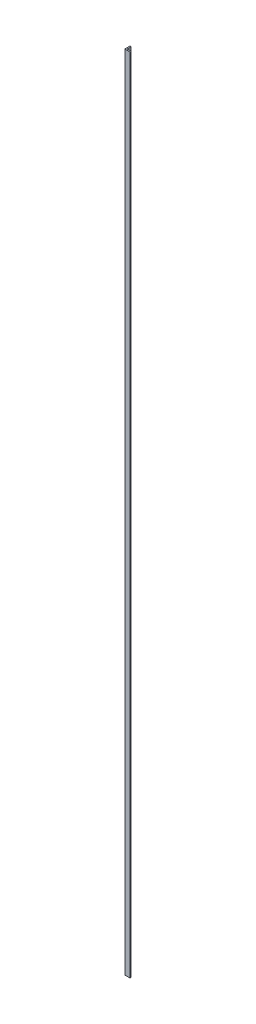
from build123d import *

# Parameters (mm, degrees)
BOSS_EXTRU_1_DEPTH = 2017


with BuildPart() as part:
    # Esquisse2 → Boss.-Extru.1 (new body)
    with BuildSketch(Plane(origin=(0, 0, 0), x_dir=(1, 0, 0), z_dir=(0, 1, 0))):
        with BuildLine():
            Line((0, 13), (0, 0))
            Line((0, 0), (13, 0))
            Line((13, 0), (13, 3))
            Line((13, 3), (4.5, 3))
            ThreePointArc((4.5, 3), (3.439339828, 3.439339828), (3, 4.5))
            Line((3, 4.5), (3, 13))
            Line((3, 13), (0, 13))
        make_face()
    extrude(amount=BOSS_EXTRU_1_DEPTH)


solid = part.part
